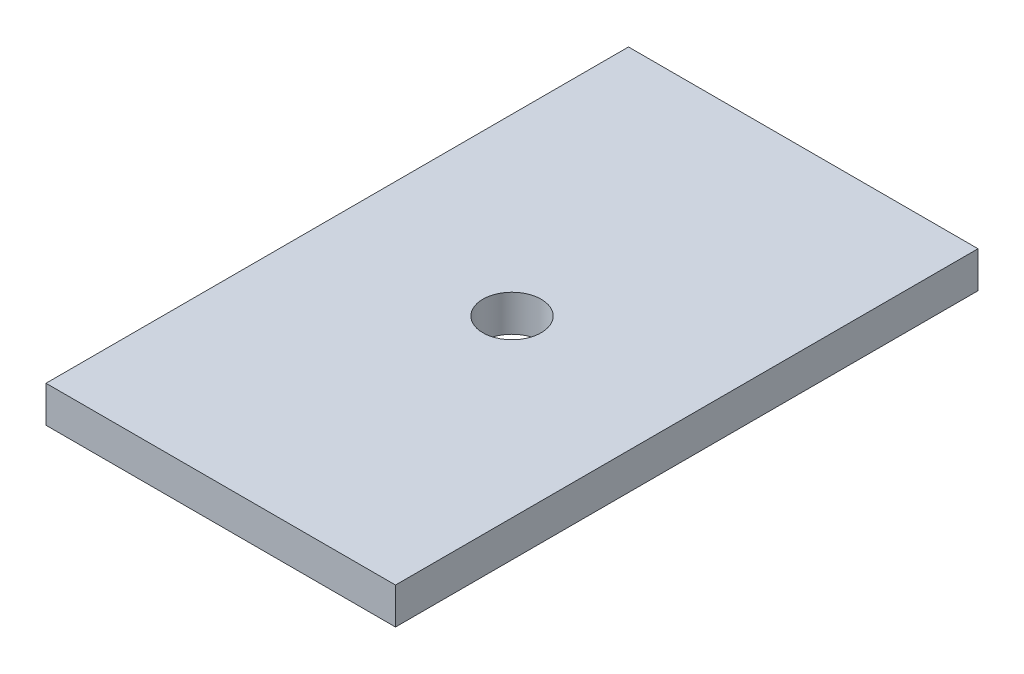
from build123d import *

# Parameters (mm, degrees)
SKETCH2_W          = 304.8
SKETCH2_H          = 508
BASE_EXTRUDE_DEPTH = 31.75
SKETCH3_R          = 25.4
CUT_EXTRUDE1_DEPTH = 532.317064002


with BuildPart() as part:
    # Sketch2 → Base-Extrude (new body)
    with BuildSketch(Plane(origin=(0, 0, 0), x_dir=(1, 0, 0), z_dir=(0, 1, 0))):
        with Locations((0, -254)):
            Rectangle(SKETCH2_W, SKETCH2_H)
    extrude(amount=BASE_EXTRUDE_DEPTH)

    # Sketch3 → Cut-Extrude1 (cut, through all)
    with BuildSketch(Plane(origin=(0, 31.75, 0), x_dir=(-1, 0, 0), z_dir=(0, 1, 0))):
        with Locations(Location((0, 254, 0), (0, 0, 90))):
            Circle(SKETCH3_R)
    extrude(amount=-CUT_EXTRUDE1_DEPTH, mode=Mode.SUBTRACT)


solid = part.part
